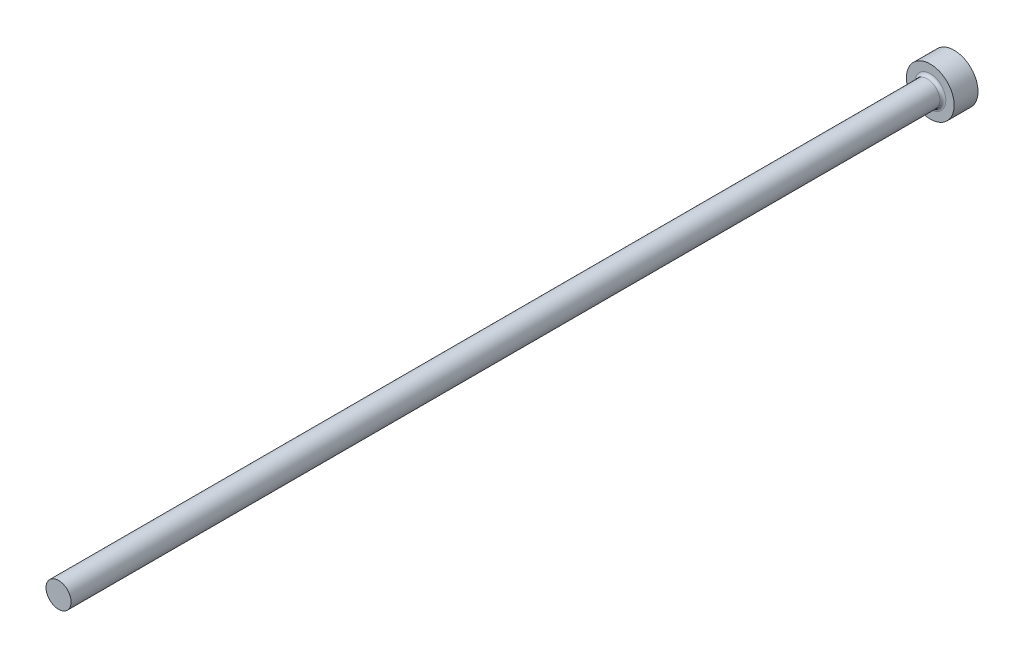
ISO-10303-21;
HEADER;
FILE_DESCRIPTION(('STEP AP214'),'2;1');
FILE_NAME('part.step','',(''),(''),'','','');
FILE_SCHEMA(('AUTOMOTIVE_DESIGN { 1 0 10303 214 1 1 1 1 }'));
ENDSEC;
DATA;
#1=APPLICATION_CONTEXT('core data for automotive mechanical design processes');
#2=APPLICATION_PROTOCOL_DEFINITION('international standard','automotive_design',2000,#1);
#3=PRODUCT_CONTEXT('',#1,'mechanical');
#4=PRODUCT('Part','Part','',(#3));
#5=PRODUCT_RELATED_PRODUCT_CATEGORY('part','',(#4));
#6=PRODUCT_DEFINITION_FORMATION('','',#4);
#7=PRODUCT_DEFINITION_CONTEXT('part definition',#1,'design');
#8=PRODUCT_DEFINITION('design','',#6,#7);
#9=PRODUCT_DEFINITION_SHAPE('','',#8);
#10=(LENGTH_UNIT() NAMED_UNIT(*) SI_UNIT(.MILLI.,.METRE.));
#11=(NAMED_UNIT(*) PLANE_ANGLE_UNIT() SI_UNIT($,.RADIAN.));
#12=(NAMED_UNIT(*) SI_UNIT($,.STERADIAN.) SOLID_ANGLE_UNIT());
#13=UNCERTAINTY_MEASURE_WITH_UNIT(LENGTH_MEASURE(1.E-05),#10,'distance_accuracy_value','');
#14=(GEOMETRIC_REPRESENTATION_CONTEXT(3) GLOBAL_UNCERTAINTY_ASSIGNED_CONTEXT((#13)) GLOBAL_UNIT_ASSIGNED_CONTEXT((#10,
#11,#12)) REPRESENTATION_CONTEXT('',''));
#15=CARTESIAN_POINT('',(0.,0.,0.));
#16=DIRECTION('',(0.,0.,1.));
#17=DIRECTION('',(1.,0.,0.));
#18=AXIS2_PLACEMENT_3D('',#15,#16,#17);
#19=CARTESIAN_POINT('',(4.,0.,4.));
#20=DIRECTION('',(0.,0.,-1.));
#21=DIRECTION('',(-1.,0.,0.));
#22=AXIS2_PLACEMENT_3D('',#19,#20,#21);
#23=PLANE('',#22);
#24=CARTESIAN_POINT('',(0.,0.,4.));
#25=DIRECTION('',(0.,0.,-1.));
#26=DIRECTION('',(-1.,0.,0.));
#27=AXIS2_PLACEMENT_3D('',#24,#25,#26);
#28=CIRCLE('',#27,2.60000000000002);
#29=CARTESIAN_POINT('',(-2.60000000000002,0.,4.));
#30=VERTEX_POINT('',#29);
#31=EDGE_CURVE('E40',#30,#30,#28,.T.);
#32=ORIENTED_EDGE('',*,*,#31,.T.);
#33=EDGE_LOOP('',(#32));
#34=FACE_BOUND('',#33,.T.);
#35=CARTESIAN_POINT('',(0.,0.,4.));
#36=DIRECTION('',(0.,0.,-1.));
#37=DIRECTION('',(-1.,0.,0.));
#38=AXIS2_PLACEMENT_3D('',#35,#36,#37);
#39=CIRCLE('',#38,4.);
#40=CARTESIAN_POINT('',(-4.,0.,4.));
#41=VERTEX_POINT('',#40);
#42=EDGE_CURVE('E44',#41,#41,#39,.T.);
#43=ORIENTED_EDGE('',*,*,#42,.F.);
#44=EDGE_LOOP('',(#43));
#45=FACE_BOUND('',#44,.T.);
#46=ADVANCED_FACE('F33',(#34,#45),#23,.F.);
#47=CARTESIAN_POINT('',(0.,0.,-9.03322817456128));
#48=DIRECTION('',(0.,0.,-1.));
#49=DIRECTION('',(-1.,0.,0.));
#50=AXIS2_PLACEMENT_3D('',#47,#48,#49);
#51=CYLINDRICAL_SURFACE('',#50,4.);
#52=CARTESIAN_POINT('',(0.,0.,0.));
#53=DIRECTION('',(0.,0.,-1.));
#54=DIRECTION('',(-1.,0.,0.));
#55=AXIS2_PLACEMENT_3D('',#52,#53,#54);
#56=CIRCLE('',#55,4.);
#57=CARTESIAN_POINT('',(-4.,0.,0.));
#58=VERTEX_POINT('',#57);
#59=EDGE_CURVE('E48',#58,#58,#56,.T.);
#60=ORIENTED_EDGE('',*,*,#59,.F.);
#61=EDGE_LOOP('',(#60));
#62=FACE_BOUND('',#61,.T.);
#63=ORIENTED_EDGE('',*,*,#42,.T.);
#64=EDGE_LOOP('',(#63));
#65=FACE_BOUND('',#64,.T.);
#66=ADVANCED_FACE('F68',(#62,#65),#51,.T.);
#67=CARTESIAN_POINT('',(0.,0.,0.));
#68=DIRECTION('',(0.,0.,1.));
#69=DIRECTION('',(1.,0.,0.));
#70=AXIS2_PLACEMENT_3D('',#67,#68,#69);
#71=PLANE('',#70);
#72=ORIENTED_EDGE('',*,*,#59,.T.);
#73=EDGE_LOOP('',(#72));
#74=FACE_BOUND('',#73,.T.);
#75=ADVANCED_FACE('F61',(#74),#71,.F.);
#76=CARTESIAN_POINT('',(0.,0.,150.));
#77=DIRECTION('',(0.,0.,-1.));
#78=DIRECTION('',(-1.,0.,0.));
#79=AXIS2_PLACEMENT_3D('',#76,#77,#78);
#80=PLANE('',#79);
#81=CARTESIAN_POINT('',(0.,0.,150.));
#82=DIRECTION('',(0.,0.,-1.));
#83=DIRECTION('',(-1.,0.,0.));
#84=AXIS2_PLACEMENT_3D('',#81,#82,#83);
#85=CIRCLE('',#84,2.10000000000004);
#86=CARTESIAN_POINT('',(-2.10000000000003,0.,150.));
#87=VERTEX_POINT('',#86);
#88=EDGE_CURVE('E53',#87,#87,#85,.T.);
#89=ORIENTED_EDGE('',*,*,#88,.F.);
#90=EDGE_LOOP('',(#89));
#91=FACE_BOUND('',#90,.T.);
#92=ADVANCED_FACE('F59',(#91),#80,.F.);
#93=CARTESIAN_POINT('',(0.,0.,-9.03322817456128));
#94=DIRECTION('',(0.,0.,-1.));
#95=DIRECTION('',(-1.,0.,0.));
#96=AXIS2_PLACEMENT_3D('',#93,#94,#95);
#97=CYLINDRICAL_SURFACE('',#96,2.10000000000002);
#98=CARTESIAN_POINT('',(0.,0.,4.5));
#99=DIRECTION('',(0.,0.,-1.));
#100=DIRECTION('',(-1.,0.,0.));
#101=AXIS2_PLACEMENT_3D('',#98,#99,#100);
#102=CIRCLE('',#101,2.10000000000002);
#103=CARTESIAN_POINT('',(-2.10000000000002,0.,4.5));
#104=VERTEX_POINT('',#103);
#105=EDGE_CURVE('E10',#104,#104,#102,.F.);
#106=ORIENTED_EDGE('',*,*,#105,.T.);
#107=EDGE_LOOP('',(#106));
#108=FACE_BOUND('',#107,.T.);
#109=ORIENTED_EDGE('',*,*,#88,.T.);
#110=EDGE_LOOP('',(#109));
#111=FACE_BOUND('',#110,.T.);
#112=ADVANCED_FACE('F57',(#108,#111),#97,.T.);
#113=CARTESIAN_POINT('',(0.,0.,4.5));
#114=DIRECTION('',(0.,0.,-1.));
#115=DIRECTION('',(-1.,0.,0.));
#116=AXIS2_PLACEMENT_3D('',#113,#114,#115);
#117=TOROIDAL_SURFACE('',#116,2.60000000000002,0.5);
#118=ORIENTED_EDGE('',*,*,#105,.F.);
#119=EDGE_LOOP('',(#118));
#120=FACE_BOUND('',#119,.T.);
#121=ORIENTED_EDGE('',*,*,#31,.F.);
#122=EDGE_LOOP('',(#121));
#123=FACE_BOUND('',#122,.T.);
#124=ADVANCED_FACE('F35',(#120,#123),#117,.F.);
#125=CLOSED_SHELL('',(#46,#66,#75,#92,#112,#124));
#126=MANIFOLD_SOLID_BREP('B2',#125);
#127=ADVANCED_BREP_SHAPE_REPRESENTATION('',(#18,#126),#14);
#128=SHAPE_DEFINITION_REPRESENTATION(#9,#127);
ENDSEC;
END-ISO-10303-21;
